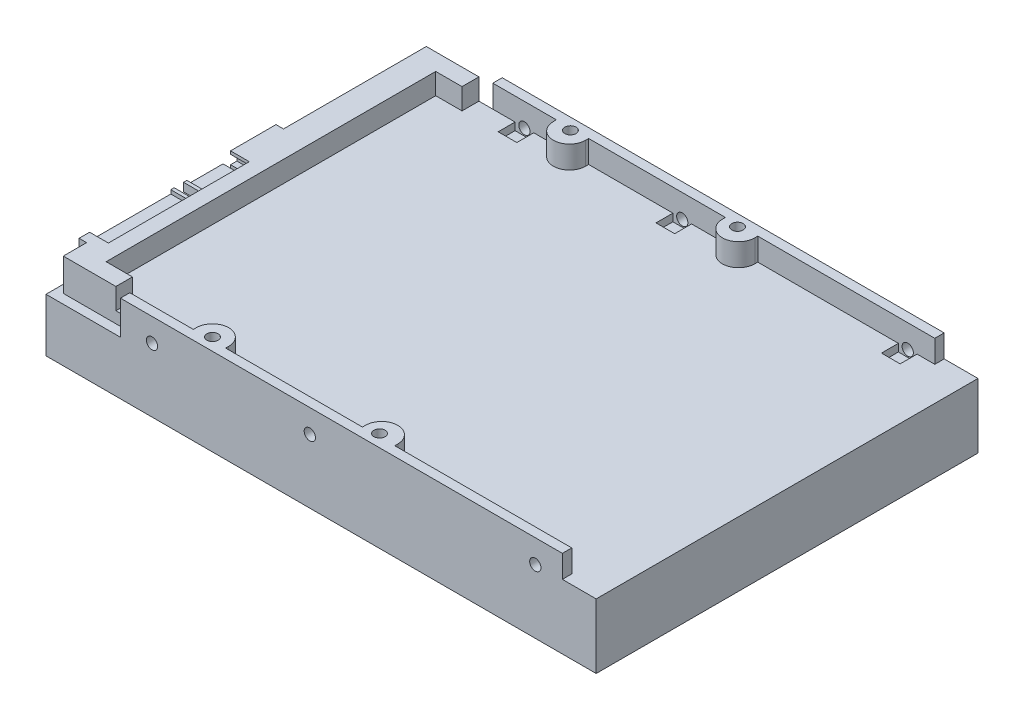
from build123d import *

# Parameters (mm, degrees)
SKETCH1_W                    = 137.4
SKETCH1_H                    = 101.6
BOSS_EXTRUDE1_DEPTH          = 17.2
SKETCH2_W                    = 2.1
SKETCH2_H                    = 3
CUT_EXTRUDE1_DEPTH           = 130.216813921
SKETCH3_W                    = 17.7
SKETCH3_H                    = 2.5
CUT_EXTRUDE2_DEPTH           = 3
SKETCH4_W                    = 117.6
SKETCH4_H                    = 2.5
BOSS_EXTRUDE2_DEPTH          = 6
SKETCH5_W                    = 17.7
SKETCH5_H                    = 2.5
CUT_EXTRUDE3_DEPTH           = 3
SKETCH6_W                    = 14
SKETCH6_H                    = 96.6
BOSS_EXTRUDE3_DEPTH          = 5.6
SKETCH7_W                    = 4.97321375
SKETCH7_H                    = 4.5
CUT_EXTRUDE4_DEPTH           = 2
SKETCH8_W                    = 4.97321375
SKETCH8_H                    = 4.5
CUT_EXTRUDE5_DEPTH           = 2
SKETCH9_W                    = 4.97321375
SKETCH9_H                    = 4.5
CUT_EXTRUDE6_DEPTH           = 2
SKETCH10_W                   = 101.6
SKETCH10_H                   = 17.2
BOSS_EXTRUDE4_DEPTH          = 9
SKETCH11_W                   = 117.6
SKETCH11_H                   = 6
BOSS_EXTRUDE5_DEPTH          = 2.5
SKETCH12_W                   = 4.97321375
SKETCH12_H                   = 4.5
CUT_EXTRUDE7_DEPTH           = 2
SKETCH13_W                   = 4.97321375
SKETCH13_H                   = 4.5
CUT_EXTRUDE8_DEPTH           = 2
SKETCH14_W                   = 4.97321375
SKETCH14_H                   = 4.5
CUT_EXTRUDE9_DEPTH           = 2
SKETCH15_W                   = 37.5
SKETCH15_H                   = 5.7
CUT_EXTRUDE10_DEPTH          = 3
SKETCH16_W                   = 2.8
SKETCH16_H                   = 4
BOSS_EXTRUDE6_DEPTH          = 2
SKETCH17_W                   = 5
SKETCH17_H                   = 2.4
CUT_EXTRUDE11_DEPTH          = 2
SKETCH18_W                   = 12.1
SKETCH18_H                   = 4
BOSS_EXTRUDE7_DEPTH          = 2
SKETCH19_W                   = 1.7
SKETCH19_H                   = 2.4
CUT_EXTRUDE12_DEPTH          = 5
SKETCH20_W                   = 7
SKETCH20_H                   = 87.7
CUT_EXTRUDE13_DEPTH          = 5.6
BOSS_EXTRUDE8_DEPTH          = 6
BOSS_EXTRUDE9_DEPTH          = 6
BOSS_EXTRUDE10_DEPTH         = 6
BOSS_EXTRUDE11_DEPTH         = 6
BOSS_EXTRUDE12_DEPTH         = 3
BOSS_EXTRUDE13_DEPTH         = 5
BOSS_EXTRUDE14_DEPTH         = 5
SKETCH28_W                   = 8.6
SKETCH28_H                   = 2.2
CUT_EXTRUDE14_DEPTH          = 5
F_3_0_3_DIAMETER_HOLE1_D     = 3
F_3_0_3_DIAMETER_HOLE1_DEPTH = 2.5
F_3_0_3_DIAMETER_HOLE2_D     = 3
F_3_0_3_DIAMETER_HOLE2_DEPTH = 2.50005
F_3_0_3_DIAMETER_HOLE3_D     = 3
F_3_0_3_DIAMETER_HOLE3_DEPTH = 6
FILLET1_R                    = 5
FILLET2_R                    = 6
FILLET3_R                    = 8
FILLET4_R                    = 1.2


with BuildPart() as part:
    # Sketch1 → Boss-Extrude1 (new body)
    with BuildSketch(Plane(origin=(0, 29.85, 0), x_dir=(1, 0, 0), z_dir=(0, 1, 0))):
        with Locations((5.35, 5.25)):
            Rectangle(SKETCH1_W, SKETCH1_H)
    extrude(amount=-BOSS_EXTRUDE1_DEPTH)

    # Sketch2 → Cut-Extrude1 (cut, through all)
    with BuildSketch(Plane.XY.offset(45.55)):
        with Locations((-62.3, 28.35)):
            Rectangle(SKETCH2_W, SKETCH2_H)
    extrude(amount=-CUT_EXTRUDE1_DEPTH, mode=Mode.SUBTRACT)

    # Sketch3 → Cut-Extrude2 (cut)
    with BuildSketch(Plane(origin=(0, 29.85, 0), x_dir=(-1, 0, 0), z_dir=(0, 1, 0))):
        with Locations((52.4, 44.3)):
            Rectangle(SKETCH3_W, SKETCH3_H)
    extrude(amount=-CUT_EXTRUDE2_DEPTH, mode=Mode.SUBTRACT)

    # Sketch4 → Boss-Extrude2 (add)
    with BuildSketch(Plane(origin=(0, 29.85, 0), x_dir=(-1, 0, 0), z_dir=(0, 1, 0))):
        with Locations((-15.25, 44.3)):
            Rectangle(SKETCH4_W, SKETCH4_H)
    extrude(amount=BOSS_EXTRUDE2_DEPTH)

    # Sketch5 → Cut-Extrude3 (cut)
    with BuildSketch(Plane(origin=(0, 29.85, 0), x_dir=(-1, 0, 0), z_dir=(0, 1, 0))):
        with Locations((52.4, -54.8)):
            Rectangle(SKETCH5_W, SKETCH5_H)
    extrude(amount=-CUT_EXTRUDE3_DEPTH, mode=Mode.SUBTRACT)

    # Sketch6 → Boss-Extrude3 (add)
    with BuildSketch(Plane(origin=(0, 29.85, 0), x_dir=(-1, 0, 0), z_dir=(0, 1, 0))):
        with Locations((54.25, -5.25)):
            Rectangle(SKETCH6_W, SKETCH6_H)
    extrude(amount=BOSS_EXTRUDE3_DEPTH)

    # Sketch7 → Cut-Extrude4 (cut)
    with BuildSketch(Plane(origin=(0, 29.85, 0), x_dir=(-1, 0, 0), z_dir=(0, 1, 0))):
        with Locations((-66.85, 40.8)):
            Rectangle(SKETCH7_W, SKETCH7_H)
    extrude(amount=-CUT_EXTRUDE4_DEPTH, mode=Mode.SUBTRACT)

    # Sketch8 → Cut-Extrude5 (cut)
    with BuildSketch(Plane(origin=(0, 29.85, 0), x_dir=(-1, 0, 0), z_dir=(0, 1, 0))):
        with Locations((-6.85, 40.8)):
            Rectangle(SKETCH8_W, SKETCH8_H)
    extrude(amount=-CUT_EXTRUDE5_DEPTH, mode=Mode.SUBTRACT)

    # Sketch9 → Cut-Extrude6 (cut)
    with BuildSketch(Plane(origin=(0, 29.85, 0), x_dir=(-1, 0, 0), z_dir=(0, 1, 0))):
        with Locations((35.15, 40.8)):
            Rectangle(SKETCH9_W, SKETCH9_H)
    extrude(amount=-CUT_EXTRUDE6_DEPTH, mode=Mode.SUBTRACT)

    # Sketch10 → Boss-Extrude4 (add)
    with BuildSketch(Plane(origin=(74.05, 0, 0), x_dir=(0, 0, -1), z_dir=(1, 0, 0))):
        with Locations((5.25, 21.25)):
            Rectangle(SKETCH10_W, SKETCH10_H)
    extrude(amount=BOSS_EXTRUDE4_DEPTH)

    # Sketch11 → Boss-Extrude5 (add)
    with BuildSketch(Plane(origin=(0, 0, -56.05), x_dir=(-1, 0, 0), z_dir=(0, 0, -1))):
        with Locations((-15.25, 32.85)):
            Rectangle(SKETCH11_W, SKETCH11_H)
    extrude(amount=-BOSS_EXTRUDE5_DEPTH)

    # Sketch12 → Cut-Extrude7 (cut)
    with BuildSketch(Plane(origin=(0, 29.85, 0), x_dir=(-1, 0, 0), z_dir=(0, 1, 0))):
        with Locations((35.15, -51.3)):
            Rectangle(SKETCH12_W, SKETCH12_H)
    extrude(amount=-CUT_EXTRUDE7_DEPTH, mode=Mode.SUBTRACT)

    # Sketch13 → Cut-Extrude8 (cut)
    with BuildSketch(Plane(origin=(0, 29.85, 0), x_dir=(-1, 0, 0), z_dir=(0, 1, 0))):
        with Locations((-6.85, -51.3)):
            Rectangle(SKETCH13_W, SKETCH13_H)
    extrude(amount=-CUT_EXTRUDE8_DEPTH, mode=Mode.SUBTRACT)

    # Sketch14 → Cut-Extrude9 (cut)
    with BuildSketch(Plane(origin=(0, 29.85, 0), x_dir=(-1, 0, 0), z_dir=(0, 1, 0))):
        with Locations((-66.85, -51.3)):
            Rectangle(SKETCH14_W, SKETCH14_H)
    extrude(amount=-CUT_EXTRUDE9_DEPTH, mode=Mode.SUBTRACT)

    # Sketch15 → Cut-Extrude10 (cut)
    with BuildSketch(Plane.ZY.offset(61.25)):
        with Locations((15.3, 32.6)):
            Rectangle(SKETCH15_W, SKETCH15_H)
    extrude(amount=-CUT_EXTRUDE10_DEPTH, mode=Mode.SUBTRACT)

    # Sketch16 → Boss-Extrude6 (add)
    with BuildSketch(Plane.ZY.offset(61.25)):
        with Locations((35.45, 33.45)):
            Rectangle(SKETCH16_W, SKETCH16_H)
    extrude(amount=BOSS_EXTRUDE6_DEPTH)

    # Sketch17 → Cut-Extrude11 (cut)
    with BuildSketch(Plane(origin=(0, 0, 34.05), x_dir=(-1, 0, 0), z_dir=(0, 0, -1))):
        with Locations((60.75, 33.45)):
            Rectangle(SKETCH17_W, SKETCH17_H)
    extrude(amount=-CUT_EXTRUDE11_DEPTH, mode=Mode.SUBTRACT)

    # Sketch18 → Boss-Extrude7 (add)
    with BuildSketch(Plane.ZY.offset(61.25)):
        with Locations((-9.5, 33.45)):
            Rectangle(SKETCH18_W, SKETCH18_H)
    extrude(amount=BOSS_EXTRUDE7_DEPTH)

    # Sketch19 → Cut-Extrude12 (cut)
    with BuildSketch(Plane.ZY.offset(63.25)):
        with Locations((-4.3, 33.45)):
            Rectangle(SKETCH19_W, SKETCH19_H)
    extrude(amount=-CUT_EXTRUDE12_DEPTH, mode=Mode.SUBTRACT)

    # Sketch20 → Cut-Extrude13 (cut)
    with BuildSketch(Plane(origin=(0, 35.45, 0), x_dir=(-1, 0, 0), z_dir=(0, 1, 0))):
        with Locations((50.75, -5.2)):
            Rectangle(SKETCH20_W, SKETCH20_H)
    extrude(amount=-CUT_EXTRUDE13_DEPTH, mode=Mode.SUBTRACT)

    # Sketch21 → Boss-Extrude8 (add)
    with BuildSketch(Plane(origin=(0, 29.85, 0), x_dir=(-1, 0, 0), z_dir=(0, 1, 0))):
        with BuildLine():
            Line((26.65, -53.55), (18.05, -53.55))
            Line((18.05, -53.55), (18.05, -52.75))
            ThreePointArc((18.05, -52.75), (22.35, -48.45), (26.65, -52.75))
            Line((26.65, -52.75), (26.65, -53.55))
        make_face()
    extrude(amount=BOSS_EXTRUDE8_DEPTH)

    # Sketch22 → Boss-Extrude9 (add)
    with BuildSketch(Plane(origin=(0, 29.85, 0), x_dir=(-1, 0, 0), z_dir=(0, 1, 0))):
        with BuildLine():
            Line((-18.35, -53.55), (-26.95, -53.55))
            Line((-26.95, -53.55), (-26.95, -52.75))
            ThreePointArc((-26.95, -52.75), (-22.65, -48.45), (-18.35, -52.75))
            Line((-18.35, -52.75), (-18.35, -53.55))
        make_face()
    extrude(amount=BOSS_EXTRUDE9_DEPTH)

    # Sketch23 → Boss-Extrude10 (add)
    with BuildSketch(Plane(origin=(0, 29.85, 0), x_dir=(-1, 0, 0), z_dir=(0, 1, 0))):
        with BuildLine():
            Line((-26.95, 43.05), (-18.35, 43.05))
            Line((-18.35, 43.05), (-18.35, 42.25))
            ThreePointArc((-18.35, 42.25), (-22.65, 37.95), (-26.95, 42.25))
            Line((-26.95, 42.25), (-26.95, 43.05))
        make_face()
    extrude(amount=BOSS_EXTRUDE10_DEPTH)

    # Sketch24 → Boss-Extrude11 (add)
    with BuildSketch(Plane(origin=(0, 29.85, 0), x_dir=(-1, 0, 0), z_dir=(0, 1, 0))):
        with BuildLine():
            Line((18.05, 43.05), (26.65, 43.05))
            Line((26.65, 43.05), (26.65, 42.25))
            ThreePointArc((26.65, 42.25), (22.35, 37.95), (18.05, 42.25))
            Line((18.05, 42.25), (18.05, 43.05))
        make_face()
    extrude(amount=BOSS_EXTRUDE11_DEPTH)

    # Sketch25 → Boss-Extrude12 (add)
    with BuildSketch(Plane.XZ.offset(-12.65)):
        with BuildLine():
            Line((62.05, 42.35), (79.75, 24.55))
            Line((79.75, 24.55), (79.75, -35.05))
            Line((79.75, -35.05), (62.05, -52.85))
            Line((62.05, -52.85), (30.885342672, -52.85))
            Line((30.885342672, -52.85), (3.242393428, -46.089848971))
            ThreePointArc((3.242393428, -46.089848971), (0.539112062, -50.929423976), (-4.660946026, -52.85))
            Line((-4.660946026, -52.85), (-42.35, -52.85))
            Line((-42.35, -52.85), (-60.05, -35.05))
            Line((-60.05, -35.05), (-60.05, 24.55))
            Line((-60.05, 24.55), (-42.35, 42.35))
            Line((-42.35, 42.35), (-8.994789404, 42.35))
            ThreePointArc((-8.994789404, 42.35), (-3, 36.6), (2.994789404, 42.35))
            Line((2.994789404, 42.35), (62.05, 42.35))
        make_face()
    extrude(amount=BOSS_EXTRUDE12_DEPTH)

    # Sketch26 → Boss-Extrude13 (add)
    with BuildSketch(Plane.ZY.offset(58.25)):
        Polygon((12.45, 34.45), (12.45, 33.45), (32.05, 33.45), (32.05, 32.25), (11.55, 32.25), (11.55, 34.45), align=None)
    extrude(amount=BOSS_EXTRUDE13_DEPTH)

    # Sketch27 → Boss-Extrude14 (add)
    with BuildSketch(Plane.ZY.offset(58.25)):
        Polygon((9.05, 34.45), (9.05, 32.25), (-1.45, 32.25), (-1.45, 33.45), (8.15, 33.45), (8.15, 34.45), align=None)
    extrude(amount=BOSS_EXTRUDE14_DEPTH)

    # Sketch28 → Cut-Extrude14 (cut)
    with BuildSketch(Plane.ZY.offset(63.25)):
        with Locations((-10.35, 33.45)):
            Rectangle(SKETCH28_W, SKETCH28_H)
    extrude(amount=-CUT_EXTRUDE14_DEPTH, mode=Mode.SUBTRACT)

    # 3.0 _3_ Diameter Hole1
    with Locations(Plane.XY.offset(-53.55)):
        with Locations((-35.15, 29.65), (6.85, 29.65), (66.85, 29.65)):
            Hole(F_3_0_3_DIAMETER_HOLE1_D / 2, depth=F_3_0_3_DIAMETER_HOLE1_DEPTH)

    # 3.0 _3_ Diameter Hole2
    with Locations(Plane(origin=(0, 0, 43.05), x_dir=(-1, 0, 0), z_dir=(0, 0, -1))):
        with Locations((35.15, 29.65), (-6.85, 29.65), (-66.85, 29.65)):
            Hole(F_3_0_3_DIAMETER_HOLE2_D / 2, depth=F_3_0_3_DIAMETER_HOLE2_DEPTH)

    # 3.0 _3_ Diameter Hole3
    with Locations(Plane(origin=(0, 35.85, 0), x_dir=(1, 0, 0), z_dir=(0, 1, 0))):
        with Locations((-22.35, -42.25), (22.1, -42.25), (-22.35, 53), (22.1, 53)):
            Hole(F_3_0_3_DIAMETER_HOLE3_D / 2, depth=F_3_0_3_DIAMETER_HOLE3_DEPTH)

    # Fillet1
    fillet1_edges = [part.edges().sort_by_distance(p)[0] for p in [
        (62.05, 11.15, 42.35),
        (-42.35, 11.15, 42.35),
        (-60.05, 11.15, 24.55),
        (-60.05, 11.15, -35.05),
        (-42.35, 11.15, -52.85),
        (62.05, 11.15, -52.85),
        (79.75, 11.15, -35.05),
        (79.75, 11.15, 24.55),
    ]]
    fillet(fillet1_edges, radius=FILLET1_R)

    # Fillet2
    fillet2_edges = [part.edges().sort_by_distance(p)[0] for p in [
        (3.242393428, 11.15, -46.089848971),
    ]]
    fillet(fillet2_edges, radius=FILLET2_R)

    # Fillet3
    fillet3_edges = [part.edges().sort_by_distance(p)[0] for p in [
        (2.994789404, 11.15, 42.35),
        (-8.994789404, 11.15, 42.35),
        (30.885342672, 11.15, -52.85),
    ]]
    fillet(fillet3_edges, radius=FILLET3_R)

    # Fillet4
    fillet4_edges = [part.edges().sort_by_distance(p)[0] for p in [
        (-1.035638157, 9.65, -51.981419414),
        (-51.205817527, 9.65, 33.444149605),
        (34.140811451, 9.65, 42.35),
        (-60.05, 9.65, -5.25),
        (-51.205817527, 9.65, -43.944149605),
        (-22.465811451, 9.65, -52.85),
        (70.905817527, 9.65, -43.944149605),
        (79.75, 9.65, -5.25),
        (70.905817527, 9.65, 33.444149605),
        (-59.672088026, 9.65, -34.894086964),
        (61.890598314, 9.65, -52.466698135),
        (-59.672088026, 9.65, 24.394086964),
        (61.890598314, 9.65, 41.966698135),
        (-42.190598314, 9.65, -52.466698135),
        (79.372088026, 9.65, -34.894086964),
        (79.372088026, 9.65, 24.394086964),
        (-42.190598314, 9.65, 41.966698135),
        (19.01212214, 9.65, -49.946374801),
        (4.590424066, 9.65, -47.464563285),
        (-27.290811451, 9.65, 42.35),
        (-3, 9.65, 36.6),
        (45.910012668, 9.65, -52.85),
        (30.892266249, 9.65, -52.792543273),
        (4.685638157, 9.65, 41.481419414),
        (-10.685638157, 9.65, 41.481419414),
    ]]
    fillet(fillet4_edges, radius=FILLET4_R)


solid = part.part
